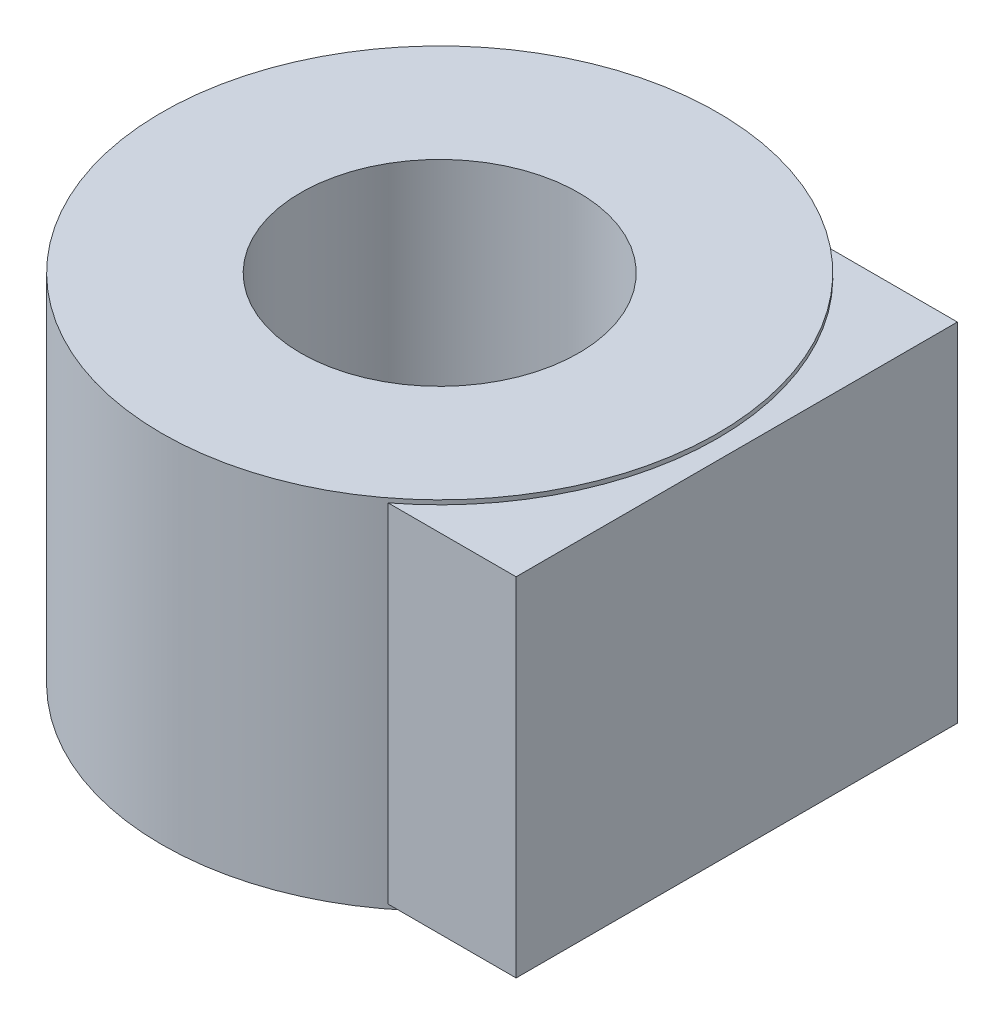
from build123d import *

# Parameters (mm, degrees)
SKETCH1_W           = 36
SKETCH1_H           = 20
BOSS_EXTRUDE1_DEPTH = 12.7
SKETCH2_R           = 16
BOSS_EXTRUDE2_DEPTH = 10.25
SKETCH3_R           = 8
CUT_EXTRUDE1_DEPTH  = 33
SKETCH4_W           = 18.902013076
SKETCH4_H           = 25.4
CUT_EXTRUDE2_DEPTH  = 43.685624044
SCALE1_SCALE        = 0.7
SCALE2_SCALE        = 0.5
SCALE3_SCALE        = 1.25


with BuildPart() as part:
    # Sketch1 → Boss-Extrude1 (new, symmetric)
    with BuildSketch(Plane.XY):
        Rectangle(SKETCH1_W, SKETCH1_H)
    extrude(amount=BOSS_EXTRUDE1_DEPTH, both=True)

    # Sketch2 → Boss-Extrude2 (add, symmetric)
    with BuildSketch(Plane(origin=(0, 0, 0), x_dir=(1, 0, 0), z_dir=(0, 1, 0))):
        with Locations(Location((-18, 0, 0), (0, 0, 270))):
            Circle(SKETCH2_R)
    extrude(amount=BOSS_EXTRUDE2_DEPTH, both=True)

    # Sketch3 → Cut-Extrude1 (cut)
    with BuildSketch(Plane(origin=(0, 10.25, 0), x_dir=(1, 0, 0), z_dir=(0, 1, 0))):
        with Locations(Location((-18, 0, 0), (0, 0, 270))):
            Circle(SKETCH3_R)
    extrude(amount=-CUT_EXTRUDE1_DEPTH, mode=Mode.SUBTRACT)

    # Sketch4 → Cut-Extrude2 (cut, through all)
    with BuildSketch(Plane(origin=(0, 10, 0), x_dir=(1, 0, 0), z_dir=(0, 1, 0))):
        with Locations((8.548993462, 0)):
            Rectangle(SKETCH4_W, SKETCH4_H)
    extrude(amount=-CUT_EXTRUDE2_DEPTH, mode=Mode.SUBTRACT)


with BuildPart() as part_1:
    # Scale1: scaled about (-16.351636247, 0, 0)
    add(part.part.scale(SCALE1_SCALE).moved(Location((-4.905490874, 0, 0))))


with BuildPart() as part_2:
    # Scale2: scaled about (-16.351636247, 0, 0)
    add(part_1.part.scale(SCALE2_SCALE).moved(Location((-8.175818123, 0, 0))))


with BuildPart() as part_3:
    # Scale3: scaled about (-16.351636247, 0, 0)
    add(part_2.part.scale(SCALE3_SCALE).moved(Location((4.087909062, 0, 0))))


solid = part_3.part
